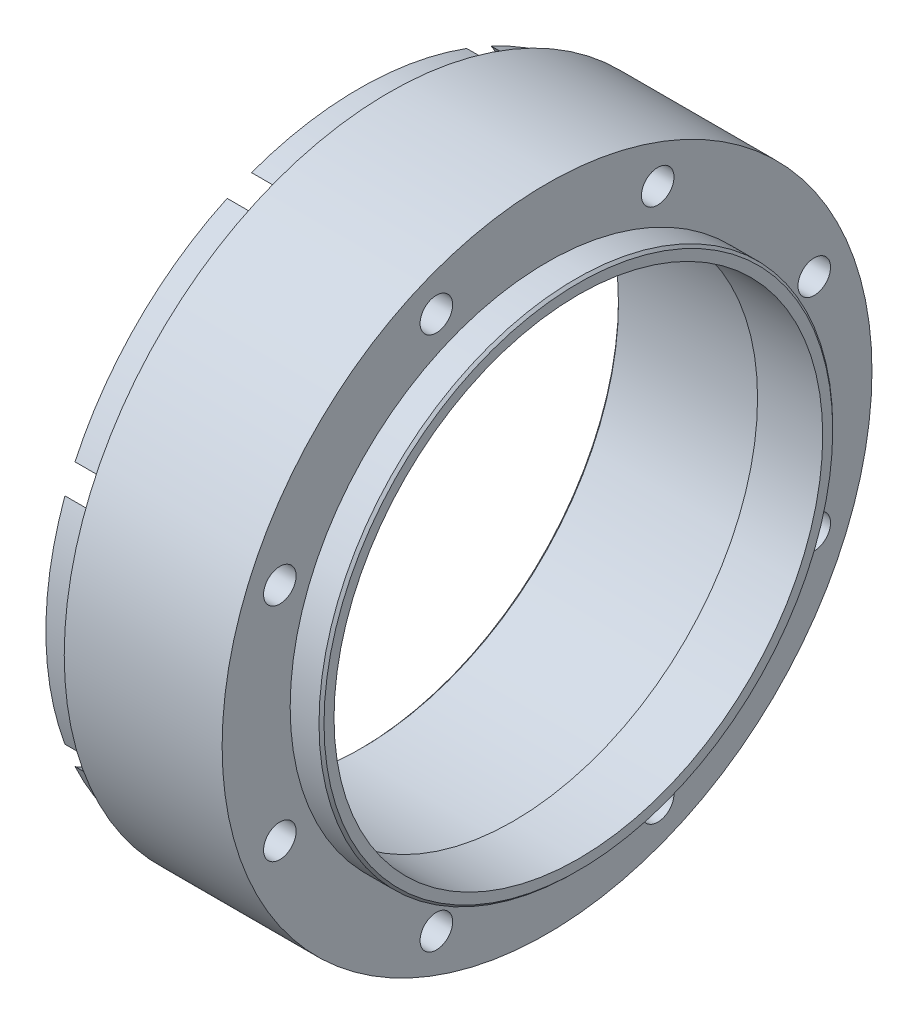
from build123d import *

# Parameters (mm, degrees)
SKETCH1_R                      = 65.8622
BOSS_EXTRUDE1_DEPTH            = 44.45
SKETCH2_R                      = 49.53
CUT_EXTRUDE1_DEPTH             = 152.4
SKETCH7_OUTSIDE_W              = 172.028
SKETCH7_OUTSIDE_H              = 172.028
SKETCH7_OUTSIDE_R              = 63.4873
CUT_EXTRUDE4_DEPTH             = 6.096
SKETCH3_OUTSIDE_W              = 172.028
SKETCH3_OUTSIDE_H              = 172.028
SKETCH3_OUTSIDE_R              = 52.07
CUT_EXTRUDE2_DEPTH             = 6.35
CIRPATTERN2_COUNT              = 8
CBORE_FOR_M6_SHCS1_D           = 6.6
CBORE_FOR_M6_SHCS1_CBORE_D     = 11
CBORE_FOR_M6_SHCS1_CBORE_DEPTH = 31.4
CIRPATTERN3_COUNT              = 8
CUT_EXTRUDE5_START             = -31.242
SKETCH12_R                     = 52.07
CUT_EXTRUDE5_DEPTH             = 31.242
CHAMFER1_SIZE                  = 0.508
CHAMFER2_SIZE                  = 0.508


with BuildPart() as part:
    # Sketch1 → Boss-Extrude1 (new body)
    with BuildSketch(Plane(origin=(0, 0, 0), x_dir=(0, 0, -1), z_dir=(1, 0, 0))):
        Circle(SKETCH1_R)
    extrude(amount=BOSS_EXTRUDE1_DEPTH)

    # Sketch2 → Cut-Extrude1 (cut)
    with BuildSketch(Plane(origin=(44.45, 0, 0), x_dir=(0, 0, -1), z_dir=(1, 0, 0))):
        Circle(SKETCH2_R)
    extrude(amount=-CUT_EXTRUDE1_DEPTH, mode=Mode.SUBTRACT)

    # Sketch7 outside → Cut-Extrude4 (cut)
    with BuildSketch(Plane.ZY):
        Rectangle(SKETCH7_OUTSIDE_W, SKETCH7_OUTSIDE_H)
        Circle(SKETCH7_OUTSIDE_R, mode=Mode.SUBTRACT)
    extrude(amount=-CUT_EXTRUDE4_DEPTH, mode=Mode.SUBTRACT)

    # Sketch3 outside → Cut-Extrude2 (cut)
    with BuildSketch(Plane(origin=(44.45, 0, 0), x_dir=(0, 0, -1), z_dir=(1, 0, 0))):
        Rectangle(SKETCH3_OUTSIDE_W, SKETCH3_OUTSIDE_H)
        Circle(SKETCH3_OUTSIDE_R, mode=Mode.SUBTRACT)
    extrude(amount=-CUT_EXTRUDE2_DEPTH, mode=Mode.SUBTRACT)

    # Sketch9 → Tapped Hole for _8-32 Helicoil1 (revolve, cut)
    with BuildSketch(Plane.ZX.offset(60.198)):
        Polygon((0, 0), (0, 16.839550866), (2.1971, 15.5194), (2.1971, 0), align=None)
    tapped_hole_for_8_32_helicoil1 = revolve(axis=Axis((-6.35, 60.198, 0), (1, 0, 0)), mode=Mode.SUBTRACT)

    # CirPattern2: Tapped Hole for _8-32 Helicoil1 ×8 about axis
    cirpattern2_axis = Axis((0, 0, 0), (1, 0, 0))
    for i in range(1, CIRPATTERN2_COUNT):
        add(tapped_hole_for_8_32_helicoil1.rotate(cirpattern2_axis, i * 360 / CIRPATTERN2_COUNT), mode=Mode.SUBTRACT)

    # CBORE for M6 SHCS1 (through all)
    with Locations(Plane.ZY):
        with Locations((22.434807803, 54.162417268)):
            cbore_for_m6_shcs1 = CounterBoreHole(CBORE_FOR_M6_SHCS1_D / 2, CBORE_FOR_M6_SHCS1_CBORE_D / 2, CBORE_FOR_M6_SHCS1_CBORE_DEPTH)

    # CirPattern3: CBORE for M6 SHCS1 ×8 about axis
    cirpattern3_axis = Axis((0, 0, 0), (1, 0, 0))
    for i in range(1, CIRPATTERN3_COUNT):
        add(cbore_for_m6_shcs1.rotate(cirpattern3_axis, i * 360 / CIRPATTERN3_COUNT), mode=Mode.SUBTRACT)

    # Sketch12 → Cut-Extrude5 (cut)
    with BuildSketch(Plane.ZY.offset(CUT_EXTRUDE5_START)):
        with Locations(Location((0, 0, 0), (0, 0, 180))):
            Circle(SKETCH12_R)
    extrude(amount=CUT_EXTRUDE5_DEPTH, mode=Mode.SUBTRACT)

    # Chamfer1
    chamfer1_edges = [part.edges().sort_by_distance(p)[0] for p in [
        (44.45, 0, 52.07),
    ]]
    chamfer(chamfer1_edges, length=CHAMFER1_SIZE)

    # Chamfer2
    chamfer2_edges = [part.edges().sort_by_distance(p)[0] for p in [
        (0, 0, 52.07),
    ]]
    chamfer(chamfer2_edges, length=CHAMFER2_SIZE)


solid = part.part
